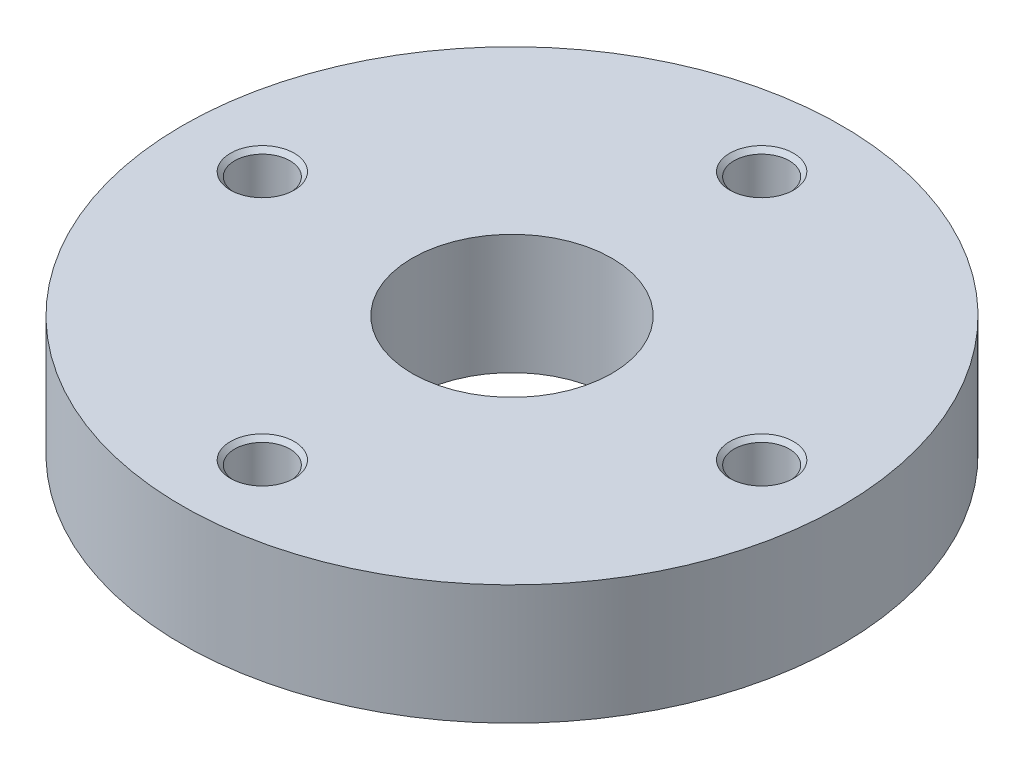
ISO-10303-21;
HEADER;
FILE_DESCRIPTION(('STEP AP214'),'2;1');
FILE_NAME('part.step','',(''),(''),'','','');
FILE_SCHEMA(('AUTOMOTIVE_DESIGN { 1 0 10303 214 1 1 1 1 }'));
ENDSEC;
DATA;
#1=APPLICATION_CONTEXT('core data for automotive mechanical design processes');
#2=APPLICATION_PROTOCOL_DEFINITION('international standard','automotive_design',2000,#1);
#3=PRODUCT_CONTEXT('',#1,'mechanical');
#4=PRODUCT('Part','Part','',(#3));
#5=PRODUCT_RELATED_PRODUCT_CATEGORY('part','',(#4));
#6=PRODUCT_DEFINITION_FORMATION('','',#4);
#7=PRODUCT_DEFINITION_CONTEXT('part definition',#1,'design');
#8=PRODUCT_DEFINITION('design','',#6,#7);
#9=PRODUCT_DEFINITION_SHAPE('','',#8);
#10=(LENGTH_UNIT() NAMED_UNIT(*) SI_UNIT(.MILLI.,.METRE.));
#11=(NAMED_UNIT(*) PLANE_ANGLE_UNIT() SI_UNIT($,.RADIAN.));
#12=(NAMED_UNIT(*) SI_UNIT($,.STERADIAN.) SOLID_ANGLE_UNIT());
#13=UNCERTAINTY_MEASURE_WITH_UNIT(LENGTH_MEASURE(1.E-05),#10,'distance_accuracy_value','');
#14=(GEOMETRIC_REPRESENTATION_CONTEXT(3) GLOBAL_UNCERTAINTY_ASSIGNED_CONTEXT((#13)) GLOBAL_UNIT_ASSIGNED_CONTEXT((#10,
#11,#12)) REPRESENTATION_CONTEXT('',''));
#15=CARTESIAN_POINT('',(0.,0.,0.));
#16=DIRECTION('',(0.,0.,1.));
#17=DIRECTION('',(1.,0.,0.));
#18=AXIS2_PLACEMENT_3D('',#15,#16,#17);
#19=CARTESIAN_POINT('',(0.,15.,0.));
#20=DIRECTION('',(0.,-1.,0.));
#21=DIRECTION('',(1.,0.,0.));
#22=AXIS2_PLACEMENT_3D('',#19,#20,#21);
#23=CYLINDRICAL_SURFACE('',#22,82.5);
#24=CARTESIAN_POINT('',(0.,0.,0.));
#25=DIRECTION('',(0.,1.,0.));
#26=DIRECTION('',(1.,0.,0.));
#27=AXIS2_PLACEMENT_3D('',#24,#25,#26);
#28=CIRCLE('',#27,82.5);
#29=CARTESIAN_POINT('',(82.5,0.,0.));
#30=VERTEX_POINT('',#29);
#31=EDGE_CURVE('E9',#30,#30,#28,.T.);
#32=ORIENTED_EDGE('',*,*,#31,.T.);
#33=EDGE_LOOP('',(#32));
#34=FACE_BOUND('',#33,.T.);
#35=CARTESIAN_POINT('',(0.,30.,0.));
#36=DIRECTION('',(0.,1.,0.));
#37=DIRECTION('',(1.,0.,0.));
#38=AXIS2_PLACEMENT_3D('',#35,#36,#37);
#39=CIRCLE('',#38,82.5);
#40=CARTESIAN_POINT('',(82.5,30.,0.));
#41=VERTEX_POINT('',#40);
#42=EDGE_CURVE('E125',#41,#41,#39,.T.);
#43=ORIENTED_EDGE('',*,*,#42,.F.);
#44=EDGE_LOOP('',(#43));
#45=FACE_BOUND('',#44,.T.);
#46=ADVANCED_FACE('F15',(#34,#45),#23,.T.);
#47=CARTESIAN_POINT('',(53.75,0.,0.));
#48=DIRECTION('',(0.,-1.,0.));
#49=DIRECTION('',(-1.,0.,0.));
#50=AXIS2_PLACEMENT_3D('',#47,#48,#49);
#51=PLANE('',#50);
#52=CARTESIAN_POINT('',(0.,0.,0.));
#53=DIRECTION('',(0.,1.,0.));
#54=DIRECTION('',(1.,0.,0.));
#55=AXIS2_PLACEMENT_3D('',#52,#53,#54);
#56=CIRCLE('',#55,25.);
#57=CARTESIAN_POINT('',(25.,0.,0.));
#58=VERTEX_POINT('',#57);
#59=EDGE_CURVE('E25',#58,#58,#56,.T.);
#60=ORIENTED_EDGE('',*,*,#59,.T.);
#61=EDGE_LOOP('',(#60));
#62=FACE_BOUND('',#61,.T.);
#63=ORIENTED_EDGE('',*,*,#31,.F.);
#64=EDGE_LOOP('',(#63));
#65=FACE_BOUND('',#64,.T.);
#66=ADVANCED_FACE('F216',(#62,#65),#51,.T.);
#67=CARTESIAN_POINT('',(0.,15.,0.));
#68=DIRECTION('',(0.,-1.,0.));
#69=DIRECTION('',(1.,0.,0.));
#70=AXIS2_PLACEMENT_3D('',#67,#68,#69);
#71=CYLINDRICAL_SURFACE('',#70,25.);
#72=CARTESIAN_POINT('',(0.,30.,0.));
#73=DIRECTION('',(0.,1.,0.));
#74=DIRECTION('',(1.,0.,0.));
#75=AXIS2_PLACEMENT_3D('',#72,#73,#74);
#76=CIRCLE('',#75,25.);
#77=CARTESIAN_POINT('',(25.,30.,0.));
#78=VERTEX_POINT('',#77);
#79=EDGE_CURVE('E129',#78,#78,#76,.T.);
#80=ORIENTED_EDGE('',*,*,#79,.T.);
#81=EDGE_LOOP('',(#80));
#82=FACE_BOUND('',#81,.T.);
#83=ORIENTED_EDGE('',*,*,#59,.F.);
#84=EDGE_LOOP('',(#83));
#85=FACE_BOUND('',#84,.T.);
#86=ADVANCED_FACE('F221',(#82,#85),#71,.F.);
#87=CARTESIAN_POINT('',(53.75,30.,0.));
#88=DIRECTION('',(0.,1.,0.));
#89=DIRECTION('',(1.,0.,0.));
#90=AXIS2_PLACEMENT_3D('',#87,#88,#89);
#91=PLANE('',#90);
#92=ORIENTED_EDGE('',*,*,#42,.T.);
#93=EDGE_LOOP('',(#92));
#94=FACE_BOUND('',#93,.T.);
#95=ORIENTED_EDGE('',*,*,#79,.F.);
#96=EDGE_LOOP('',(#95));
#97=FACE_BOUND('',#96,.T.);
#98=CARTESIAN_POINT('',(62.5,30.,0.));
#99=DIRECTION('',(0.,-1.,0.));
#100=DIRECTION('',(1.,0.,0.));
#101=AXIS2_PLACEMENT_3D('',#98,#99,#100);
#102=CIRCLE('',#101,8.);
#103=CARTESIAN_POINT('',(70.5,30.,0.));
#104=VERTEX_POINT('',#103);
#105=EDGE_CURVE('E152',#104,#104,#102,.T.);
#106=ORIENTED_EDGE('',*,*,#105,.T.);
#107=EDGE_LOOP('',(#106));
#108=FACE_BOUND('',#107,.T.);
#109=CARTESIAN_POINT('',(0.,30.,-62.5));
#110=DIRECTION('',(0.,-1.,0.));
#111=DIRECTION('',(0.,0.,-1.));
#112=AXIS2_PLACEMENT_3D('',#109,#110,#111);
#113=CIRCLE('',#112,8.);
#114=CARTESIAN_POINT('',(0.,30.,-70.5));
#115=VERTEX_POINT('',#114);
#116=EDGE_CURVE('E151',#115,#115,#113,.T.);
#117=ORIENTED_EDGE('',*,*,#116,.T.);
#118=EDGE_LOOP('',(#117));
#119=FACE_BOUND('',#118,.T.);
#120=CARTESIAN_POINT('',(-62.5,30.,0.));
#121=DIRECTION('',(0.,-1.,0.));
#122=DIRECTION('',(-1.,0.,0.));
#123=AXIS2_PLACEMENT_3D('',#120,#121,#122);
#124=CIRCLE('',#123,8.);
#125=CARTESIAN_POINT('',(-70.5,30.,0.));
#126=VERTEX_POINT('',#125);
#127=EDGE_CURVE('E172',#126,#126,#124,.T.);
#128=ORIENTED_EDGE('',*,*,#127,.T.);
#129=EDGE_LOOP('',(#128));
#130=FACE_BOUND('',#129,.T.);
#131=CARTESIAN_POINT('',(0.,30.,62.5));
#132=DIRECTION('',(0.,-1.,0.));
#133=DIRECTION('',(0.,0.,1.));
#134=AXIS2_PLACEMENT_3D('',#131,#132,#133);
#135=CIRCLE('',#134,8.);
#136=CARTESIAN_POINT('',(0.,30.,70.5));
#137=VERTEX_POINT('',#136);
#138=EDGE_CURVE('E96',#137,#137,#135,.T.);
#139=ORIENTED_EDGE('',*,*,#138,.T.);
#140=EDGE_LOOP('',(#139));
#141=FACE_BOUND('',#140,.T.);
#142=ADVANCED_FACE('F261',(#94,#97,#108,#119,#130,#141),#91,.T.);
#143=CARTESIAN_POINT('',(62.5,5.00308975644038,0.));
#144=DIRECTION('',(0.,1.,0.));
#145=DIRECTION('',(1.,0.,0.));
#146=AXIS2_PLACEMENT_3D('',#143,#144,#145);
#147=CONICAL_SURFACE('',#146,3.45875,1.0471975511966);
#148=CARTESIAN_POINT('',(62.5,7.,0.));
#149=DIRECTION('',(0.,-1.,0.));
#150=DIRECTION('',(1.,0.,0.));
#151=AXIS2_PLACEMENT_3D('',#148,#149,#150);
#152=CIRCLE('',#151,6.9175);
#153=CARTESIAN_POINT('',(69.4175,7.,0.));
#154=VERTEX_POINT('',#153);
#155=EDGE_CURVE('E133',#154,#154,#152,.T.);
#156=ORIENTED_EDGE('',*,*,#155,.F.);
#157=EDGE_LOOP('',(#156));
#158=FACE_BOUND('',#157,.T.);
#159=CARTESIAN_POINT('',(62.5,3.00617951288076,0.));
#160=VERTEX_POINT('',#159);
#161=VERTEX_LOOP('',#160);
#162=FACE_BOUND('',#161,.T.);
#163=ADVANCED_FACE('F257',(#158,#162),#147,.F.);
#164=CARTESIAN_POINT('',(62.5,9.95875,0.));
#165=DIRECTION('',(0.,1.,0.));
#166=DIRECTION('',(1.,0.,0.));
#167=AXIS2_PLACEMENT_3D('',#164,#165,#166);
#168=CYLINDRICAL_SURFACE('',#167,6.9175);
#169=CARTESIAN_POINT('',(62.5,12.9175,0.));
#170=DIRECTION('',(0.,-1.,0.));
#171=DIRECTION('',(1.,0.,0.));
#172=AXIS2_PLACEMENT_3D('',#169,#170,#171);
#173=CIRCLE('',#172,6.9175);
#174=CARTESIAN_POINT('',(69.4175,12.9175,0.));
#175=VERTEX_POINT('',#174);
#176=EDGE_CURVE('E137',#175,#175,#173,.T.);
#177=ORIENTED_EDGE('',*,*,#176,.F.);
#178=EDGE_LOOP('',(#177));
#179=FACE_BOUND('',#178,.T.);
#180=ORIENTED_EDGE('',*,*,#155,.T.);
#181=EDGE_LOOP('',(#180));
#182=FACE_BOUND('',#181,.T.);
#183=ADVANCED_FACE('F260',(#179,#182),#168,.F.);
#184=CARTESIAN_POINT('',(62.5,13.45875,0.));
#185=DIRECTION('',(0.,1.,0.));
#186=DIRECTION('',(1.,0.,0.));
#187=AXIS2_PLACEMENT_3D('',#184,#185,#186);
#188=CONICAL_SURFACE('',#187,7.45875,0.785398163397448);
#189=CARTESIAN_POINT('',(62.5,14.,0.));
#190=DIRECTION('',(0.,-1.,0.));
#191=DIRECTION('',(1.,0.,0.));
#192=AXIS2_PLACEMENT_3D('',#189,#190,#191);
#193=CIRCLE('',#192,8.);
#194=CARTESIAN_POINT('',(70.5,14.,0.));
#195=VERTEX_POINT('',#194);
#196=EDGE_CURVE('E139',#195,#195,#193,.T.);
#197=ORIENTED_EDGE('',*,*,#196,.F.);
#198=EDGE_LOOP('',(#197));
#199=FACE_BOUND('',#198,.T.);
#200=ORIENTED_EDGE('',*,*,#176,.T.);
#201=EDGE_LOOP('',(#200));
#202=FACE_BOUND('',#201,.T.);
#203=ADVANCED_FACE('F17',(#199,#202),#188,.F.);
#204=CARTESIAN_POINT('',(69.95875,14.,0.));
#205=DIRECTION('',(0.,1.,0.));
#206=DIRECTION('',(-1.,0.,0.));
#207=AXIS2_PLACEMENT_3D('',#204,#205,#206);
#208=PLANE('',#207);
#209=CARTESIAN_POINT('',(62.5,14.,0.));
#210=DIRECTION('',(0.,-1.,0.));
#211=DIRECTION('',(1.,0.,0.));
#212=AXIS2_PLACEMENT_3D('',#209,#210,#211);
#213=CIRCLE('',#212,6.9175);
#214=CARTESIAN_POINT('',(69.4175,14.,0.));
#215=VERTEX_POINT('',#214);
#216=EDGE_CURVE('E142',#215,#215,#213,.T.);
#217=ORIENTED_EDGE('',*,*,#216,.F.);
#218=EDGE_LOOP('',(#217));
#219=FACE_BOUND('',#218,.T.);
#220=ORIENTED_EDGE('',*,*,#196,.T.);
#221=EDGE_LOOP('',(#220));
#222=FACE_BOUND('',#221,.T.);
#223=ADVANCED_FACE('F275',(#219,#222),#208,.F.);
#224=CARTESIAN_POINT('',(62.5,21.45875,0.));
#225=DIRECTION('',(0.,1.,0.));
#226=DIRECTION('',(1.,0.,0.));
#227=AXIS2_PLACEMENT_3D('',#224,#225,#226);
#228=CYLINDRICAL_SURFACE('',#227,6.9175);
#229=CARTESIAN_POINT('',(62.5,28.9175,0.));
#230=DIRECTION('',(0.,-1.,0.));
#231=DIRECTION('',(1.,0.,0.));
#232=AXIS2_PLACEMENT_3D('',#229,#230,#231);
#233=CIRCLE('',#232,6.9175);
#234=CARTESIAN_POINT('',(69.4175,28.9175,0.));
#235=VERTEX_POINT('',#234);
#236=EDGE_CURVE('E146',#235,#235,#233,.T.);
#237=ORIENTED_EDGE('',*,*,#236,.F.);
#238=EDGE_LOOP('',(#237));
#239=FACE_BOUND('',#238,.T.);
#240=ORIENTED_EDGE('',*,*,#216,.T.);
#241=EDGE_LOOP('',(#240));
#242=FACE_BOUND('',#241,.T.);
#243=ADVANCED_FACE('F272',(#239,#242),#228,.F.);
#244=CARTESIAN_POINT('',(62.5,29.45875,0.));
#245=DIRECTION('',(0.,1.,0.));
#246=DIRECTION('',(1.,0.,0.));
#247=AXIS2_PLACEMENT_3D('',#244,#245,#246);
#248=CONICAL_SURFACE('',#247,7.45875,0.785398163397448);
#249=ORIENTED_EDGE('',*,*,#105,.F.);
#250=EDGE_LOOP('',(#249));
#251=FACE_BOUND('',#250,.T.);
#252=ORIENTED_EDGE('',*,*,#236,.T.);
#253=EDGE_LOOP('',(#252));
#254=FACE_BOUND('',#253,.T.);
#255=ADVANCED_FACE('F250',(#251,#254),#248,.F.);
#256=CARTESIAN_POINT('',(0.,5.00308975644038,-62.5));
#257=DIRECTION('',(0.,1.,0.));
#258=DIRECTION('',(0.,0.,-1.));
#259=AXIS2_PLACEMENT_3D('',#256,#257,#258);
#260=CONICAL_SURFACE('',#259,3.45875,1.0471975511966);
#261=CARTESIAN_POINT('',(0.,7.,-62.5));
#262=DIRECTION('',(0.,-1.,0.));
#263=DIRECTION('',(0.,0.,-1.));
#264=AXIS2_PLACEMENT_3D('',#261,#262,#263);
#265=CIRCLE('',#264,6.9175);
#266=CARTESIAN_POINT('',(0.,7.,-69.4175));
#267=VERTEX_POINT('',#266);
#268=EDGE_CURVE('E159',#267,#267,#265,.T.);
#269=ORIENTED_EDGE('',*,*,#268,.F.);
#270=EDGE_LOOP('',(#269));
#271=FACE_BOUND('',#270,.T.);
#272=CARTESIAN_POINT('',(0.,3.00617951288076,-62.5));
#273=VERTEX_POINT('',#272);
#274=VERTEX_LOOP('',#273);
#275=FACE_BOUND('',#274,.T.);
#276=ADVANCED_FACE('F227',(#271,#275),#260,.F.);
#277=CARTESIAN_POINT('',(0.,9.95875,-62.5));
#278=DIRECTION('',(0.,1.,0.));
#279=DIRECTION('',(0.,0.,-1.));
#280=AXIS2_PLACEMENT_3D('',#277,#278,#279);
#281=CYLINDRICAL_SURFACE('',#280,6.9175);
#282=CARTESIAN_POINT('',(0.,12.9175,-62.5));
#283=DIRECTION('',(0.,-1.,0.));
#284=DIRECTION('',(0.,0.,-1.));
#285=AXIS2_PLACEMENT_3D('',#282,#283,#284);
#286=CIRCLE('',#285,6.9175);
#287=CARTESIAN_POINT('',(0.,12.9175,-69.4175));
#288=VERTEX_POINT('',#287);
#289=EDGE_CURVE('E157',#288,#288,#286,.T.);
#290=ORIENTED_EDGE('',*,*,#289,.F.);
#291=EDGE_LOOP('',(#290));
#292=FACE_BOUND('',#291,.T.);
#293=ORIENTED_EDGE('',*,*,#268,.T.);
#294=EDGE_LOOP('',(#293));
#295=FACE_BOUND('',#294,.T.);
#296=ADVANCED_FACE('F237',(#292,#295),#281,.F.);
#297=CARTESIAN_POINT('',(0.,13.45875,-62.5));
#298=DIRECTION('',(0.,1.,0.));
#299=DIRECTION('',(0.,0.,-1.));
#300=AXIS2_PLACEMENT_3D('',#297,#298,#299);
#301=CONICAL_SURFACE('',#300,7.45875,0.785398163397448);
#302=CARTESIAN_POINT('',(0.,14.,-62.5));
#303=DIRECTION('',(0.,-1.,0.));
#304=DIRECTION('',(0.,0.,-1.));
#305=AXIS2_PLACEMENT_3D('',#302,#303,#304);
#306=CIRCLE('',#305,8.);
#307=CARTESIAN_POINT('',(0.,14.,-70.5));
#308=VERTEX_POINT('',#307);
#309=EDGE_CURVE('E150',#308,#308,#306,.T.);
#310=ORIENTED_EDGE('',*,*,#309,.F.);
#311=EDGE_LOOP('',(#310));
#312=FACE_BOUND('',#311,.T.);
#313=ORIENTED_EDGE('',*,*,#289,.T.);
#314=EDGE_LOOP('',(#313));
#315=FACE_BOUND('',#314,.T.);
#316=ADVANCED_FACE('F234',(#312,#315),#301,.F.);
#317=CARTESIAN_POINT('',(0.,14.,-69.95875));
#318=DIRECTION('',(0.,1.,0.));
#319=DIRECTION('',(0.,0.,1.));
#320=AXIS2_PLACEMENT_3D('',#317,#318,#319);
#321=PLANE('',#320);
#322=CARTESIAN_POINT('',(0.,14.,-62.5));
#323=DIRECTION('',(0.,-1.,0.));
#324=DIRECTION('',(0.,0.,-1.));
#325=AXIS2_PLACEMENT_3D('',#322,#323,#324);
#326=CIRCLE('',#325,6.9175);
#327=CARTESIAN_POINT('',(0.,14.,-69.4175));
#328=VERTEX_POINT('',#327);
#329=EDGE_CURVE('E148',#328,#328,#326,.T.);
#330=ORIENTED_EDGE('',*,*,#329,.F.);
#331=EDGE_LOOP('',(#330));
#332=FACE_BOUND('',#331,.T.);
#333=ORIENTED_EDGE('',*,*,#309,.T.);
#334=EDGE_LOOP('',(#333));
#335=FACE_BOUND('',#334,.T.);
#336=ADVANCED_FACE('F236',(#332,#335),#321,.F.);
#337=CARTESIAN_POINT('',(0.,21.45875,-62.5));
#338=DIRECTION('',(0.,1.,0.));
#339=DIRECTION('',(0.,0.,-1.));
#340=AXIS2_PLACEMENT_3D('',#337,#338,#339);
#341=CYLINDRICAL_SURFACE('',#340,6.9175);
#342=CARTESIAN_POINT('',(0.,28.9175,-62.5));
#343=DIRECTION('',(0.,-1.,0.));
#344=DIRECTION('',(0.,0.,-1.));
#345=AXIS2_PLACEMENT_3D('',#342,#343,#344);
#346=CIRCLE('',#345,6.9175);
#347=CARTESIAN_POINT('',(0.,28.9175,-69.4175));
#348=VERTEX_POINT('',#347);
#349=EDGE_CURVE('E176',#348,#348,#346,.T.);
#350=ORIENTED_EDGE('',*,*,#349,.F.);
#351=EDGE_LOOP('',(#350));
#352=FACE_BOUND('',#351,.T.);
#353=ORIENTED_EDGE('',*,*,#329,.T.);
#354=EDGE_LOOP('',(#353));
#355=FACE_BOUND('',#354,.T.);
#356=ADVANCED_FACE('F243',(#352,#355),#341,.F.);
#357=CARTESIAN_POINT('',(0.,29.45875,-62.5));
#358=DIRECTION('',(0.,1.,0.));
#359=DIRECTION('',(0.,0.,-1.));
#360=AXIS2_PLACEMENT_3D('',#357,#358,#359);
#361=CONICAL_SURFACE('',#360,7.45875,0.785398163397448);
#362=ORIENTED_EDGE('',*,*,#116,.F.);
#363=EDGE_LOOP('',(#362));
#364=FACE_BOUND('',#363,.T.);
#365=ORIENTED_EDGE('',*,*,#349,.T.);
#366=EDGE_LOOP('',(#365));
#367=FACE_BOUND('',#366,.T.);
#368=ADVANCED_FACE('F232',(#364,#367),#361,.F.);
#369=CARTESIAN_POINT('',(-62.5,5.00308975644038,0.));
#370=DIRECTION('',(0.,1.,0.));
#371=DIRECTION('',(-1.,0.,0.));
#372=AXIS2_PLACEMENT_3D('',#369,#370,#371);
#373=CONICAL_SURFACE('',#372,3.45875,1.0471975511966);
#374=CARTESIAN_POINT('',(-62.5,7.,0.));
#375=DIRECTION('',(0.,-1.,0.));
#376=DIRECTION('',(-1.,0.,0.));
#377=AXIS2_PLACEMENT_3D('',#374,#375,#376);
#378=CIRCLE('',#377,6.9175);
#379=CARTESIAN_POINT('',(-69.4175,7.,0.));
#380=VERTEX_POINT('',#379);
#381=EDGE_CURVE('E19',#380,#380,#378,.T.);
#382=ORIENTED_EDGE('',*,*,#381,.F.);
#383=EDGE_LOOP('',(#382));
#384=FACE_BOUND('',#383,.T.);
#385=CARTESIAN_POINT('',(-62.5,3.00617951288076,0.));
#386=VERTEX_POINT('',#385);
#387=VERTEX_LOOP('',#386);
#388=FACE_BOUND('',#387,.T.);
#389=ADVANCED_FACE('F229',(#384,#388),#373,.F.);
#390=CARTESIAN_POINT('',(-62.5,9.95875,0.));
#391=DIRECTION('',(0.,1.,0.));
#392=DIRECTION('',(-1.,0.,0.));
#393=AXIS2_PLACEMENT_3D('',#390,#391,#392);
#394=CYLINDRICAL_SURFACE('',#393,6.9175);
#395=CARTESIAN_POINT('',(-62.5,12.9175,0.));
#396=DIRECTION('',(0.,-1.,0.));
#397=DIRECTION('',(-1.,0.,0.));
#398=AXIS2_PLACEMENT_3D('',#395,#396,#397);
#399=CIRCLE('',#398,6.9175);
#400=CARTESIAN_POINT('',(-69.4175,12.9175,0.));
#401=VERTEX_POINT('',#400);
#402=EDGE_CURVE('E155',#401,#401,#399,.T.);
#403=ORIENTED_EDGE('',*,*,#402,.F.);
#404=EDGE_LOOP('',(#403));
#405=FACE_BOUND('',#404,.T.);
#406=ORIENTED_EDGE('',*,*,#381,.T.);
#407=EDGE_LOOP('',(#406));
#408=FACE_BOUND('',#407,.T.);
#409=ADVANCED_FACE('F231',(#405,#408),#394,.F.);
#410=CARTESIAN_POINT('',(-62.5,13.45875,0.));
#411=DIRECTION('',(0.,1.,0.));
#412=DIRECTION('',(-1.,0.,0.));
#413=AXIS2_PLACEMENT_3D('',#410,#411,#412);
#414=CONICAL_SURFACE('',#413,7.45875,0.785398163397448);
#415=CARTESIAN_POINT('',(-62.5,14.,0.));
#416=DIRECTION('',(0.,-1.,0.));
#417=DIRECTION('',(-1.,0.,0.));
#418=AXIS2_PLACEMENT_3D('',#415,#416,#417);
#419=CIRCLE('',#418,8.);
#420=CARTESIAN_POINT('',(-70.5,14.,0.));
#421=VERTEX_POINT('',#420);
#422=EDGE_CURVE('E156',#421,#421,#419,.T.);
#423=ORIENTED_EDGE('',*,*,#422,.F.);
#424=EDGE_LOOP('',(#423));
#425=FACE_BOUND('',#424,.T.);
#426=ORIENTED_EDGE('',*,*,#402,.T.);
#427=EDGE_LOOP('',(#426));
#428=FACE_BOUND('',#427,.T.);
#429=ADVANCED_FACE('F263',(#425,#428),#414,.F.);
#430=CARTESIAN_POINT('',(-69.95875,14.,0.));
#431=DIRECTION('',(0.,1.,0.));
#432=DIRECTION('',(1.,0.,0.));
#433=AXIS2_PLACEMENT_3D('',#430,#431,#432);
#434=PLANE('',#433);
#435=CARTESIAN_POINT('',(-62.5,14.,0.));
#436=DIRECTION('',(0.,-1.,0.));
#437=DIRECTION('',(-1.,0.,0.));
#438=AXIS2_PLACEMENT_3D('',#435,#436,#437);
#439=CIRCLE('',#438,6.9175);
#440=CARTESIAN_POINT('',(-69.4175,14.,0.));
#441=VERTEX_POINT('',#440);
#442=EDGE_CURVE('E174',#441,#441,#439,.T.);
#443=ORIENTED_EDGE('',*,*,#442,.F.);
#444=EDGE_LOOP('',(#443));
#445=FACE_BOUND('',#444,.T.);
#446=ORIENTED_EDGE('',*,*,#422,.T.);
#447=EDGE_LOOP('',(#446));
#448=FACE_BOUND('',#447,.T.);
#449=ADVANCED_FACE('F266',(#445,#448),#434,.F.);
#450=CARTESIAN_POINT('',(-62.5,21.45875,0.));
#451=DIRECTION('',(0.,1.,0.));
#452=DIRECTION('',(-1.,0.,0.));
#453=AXIS2_PLACEMENT_3D('',#450,#451,#452);
#454=CYLINDRICAL_SURFACE('',#453,6.9175);
#455=CARTESIAN_POINT('',(-62.5,28.9175,0.));
#456=DIRECTION('',(0.,-1.,0.));
#457=DIRECTION('',(-1.,0.,0.));
#458=AXIS2_PLACEMENT_3D('',#455,#456,#457);
#459=CIRCLE('',#458,6.9175);
#460=CARTESIAN_POINT('',(-69.4175,28.9175,0.));
#461=VERTEX_POINT('',#460);
#462=EDGE_CURVE('E55',#461,#461,#459,.T.);
#463=ORIENTED_EDGE('',*,*,#462,.F.);
#464=EDGE_LOOP('',(#463));
#465=FACE_BOUND('',#464,.T.);
#466=ORIENTED_EDGE('',*,*,#442,.T.);
#467=EDGE_LOOP('',(#466));
#468=FACE_BOUND('',#467,.T.);
#469=ADVANCED_FACE('F299',(#465,#468),#454,.F.);
#470=CARTESIAN_POINT('',(-62.5,29.45875,0.));
#471=DIRECTION('',(0.,1.,0.));
#472=DIRECTION('',(-1.,0.,0.));
#473=AXIS2_PLACEMENT_3D('',#470,#471,#472);
#474=CONICAL_SURFACE('',#473,7.45875,0.785398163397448);
#475=ORIENTED_EDGE('',*,*,#127,.F.);
#476=EDGE_LOOP('',(#475));
#477=FACE_BOUND('',#476,.T.);
#478=ORIENTED_EDGE('',*,*,#462,.T.);
#479=EDGE_LOOP('',(#478));
#480=FACE_BOUND('',#479,.T.);
#481=ADVANCED_FACE('F210',(#477,#480),#474,.F.);
#482=CARTESIAN_POINT('',(0.,5.00308975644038,62.5));
#483=DIRECTION('',(0.,1.,0.));
#484=DIRECTION('',(0.,0.,1.));
#485=AXIS2_PLACEMENT_3D('',#482,#483,#484);
#486=CONICAL_SURFACE('',#485,3.45875,1.0471975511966);
#487=CARTESIAN_POINT('',(0.,7.,62.5));
#488=DIRECTION('',(0.,-1.,0.));
#489=DIRECTION('',(0.,0.,1.));
#490=AXIS2_PLACEMENT_3D('',#487,#488,#489);
#491=CIRCLE('',#490,6.9175);
#492=CARTESIAN_POINT('',(0.,7.,69.4175));
#493=VERTEX_POINT('',#492);
#494=EDGE_CURVE('E64',#493,#493,#491,.T.);
#495=ORIENTED_EDGE('',*,*,#494,.F.);
#496=EDGE_LOOP('',(#495));
#497=FACE_BOUND('',#496,.T.);
#498=CARTESIAN_POINT('',(0.,3.00617951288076,62.5));
#499=VERTEX_POINT('',#498);
#500=VERTEX_LOOP('',#499);
#501=FACE_BOUND('',#500,.T.);
#502=ADVANCED_FACE('F204',(#497,#501),#486,.F.);
#503=CARTESIAN_POINT('',(0.,9.95875,62.5));
#504=DIRECTION('',(0.,1.,0.));
#505=DIRECTION('',(0.,0.,1.));
#506=AXIS2_PLACEMENT_3D('',#503,#504,#505);
#507=CYLINDRICAL_SURFACE('',#506,6.9175);
#508=CARTESIAN_POINT('',(0.,12.9175,62.5));
#509=DIRECTION('',(0.,-1.,0.));
#510=DIRECTION('',(0.,0.,1.));
#511=AXIS2_PLACEMENT_3D('',#508,#509,#510);
#512=CIRCLE('',#511,6.9175);
#513=CARTESIAN_POINT('',(0.,12.9175,69.4175));
#514=VERTEX_POINT('',#513);
#515=EDGE_CURVE('E189',#514,#514,#512,.T.);
#516=ORIENTED_EDGE('',*,*,#515,.F.);
#517=EDGE_LOOP('',(#516));
#518=FACE_BOUND('',#517,.T.);
#519=ORIENTED_EDGE('',*,*,#494,.T.);
#520=EDGE_LOOP('',(#519));
#521=FACE_BOUND('',#520,.T.);
#522=ADVANCED_FACE('F199',(#518,#521),#507,.F.);
#523=CARTESIAN_POINT('',(0.,13.45875,62.5));
#524=DIRECTION('',(0.,1.,0.));
#525=DIRECTION('',(0.,0.,1.));
#526=AXIS2_PLACEMENT_3D('',#523,#524,#525);
#527=CONICAL_SURFACE('',#526,7.45875,0.785398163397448);
#528=CARTESIAN_POINT('',(0.,14.,62.5));
#529=DIRECTION('',(0.,-1.,0.));
#530=DIRECTION('',(0.,0.,1.));
#531=AXIS2_PLACEMENT_3D('',#528,#529,#530);
#532=CIRCLE('',#531,8.);
#533=CARTESIAN_POINT('',(0.,14.,70.5));
#534=VERTEX_POINT('',#533);
#535=EDGE_CURVE('E191',#534,#534,#532,.T.);
#536=ORIENTED_EDGE('',*,*,#535,.F.);
#537=EDGE_LOOP('',(#536));
#538=FACE_BOUND('',#537,.T.);
#539=ORIENTED_EDGE('',*,*,#515,.T.);
#540=EDGE_LOOP('',(#539));
#541=FACE_BOUND('',#540,.T.);
#542=ADVANCED_FACE('F196',(#538,#541),#527,.F.);
#543=CARTESIAN_POINT('',(0.,14.,69.95875));
#544=DIRECTION('',(0.,1.,0.));
#545=DIRECTION('',(0.,0.,-1.));
#546=AXIS2_PLACEMENT_3D('',#543,#544,#545);
#547=PLANE('',#546);
#548=CARTESIAN_POINT('',(0.,14.,62.5));
#549=DIRECTION('',(0.,-1.,0.));
#550=DIRECTION('',(0.,0.,1.));
#551=AXIS2_PLACEMENT_3D('',#548,#549,#550);
#552=CIRCLE('',#551,6.9175);
#553=CARTESIAN_POINT('',(0.,14.,69.4175));
#554=VERTEX_POINT('',#553);
#555=EDGE_CURVE('E101',#554,#554,#552,.T.);
#556=ORIENTED_EDGE('',*,*,#555,.F.);
#557=EDGE_LOOP('',(#556));
#558=FACE_BOUND('',#557,.T.);
#559=ORIENTED_EDGE('',*,*,#535,.T.);
#560=EDGE_LOOP('',(#559));
#561=FACE_BOUND('',#560,.T.);
#562=ADVANCED_FACE('F194',(#558,#561),#547,.F.);
#563=CARTESIAN_POINT('',(0.,21.45875,62.5));
#564=DIRECTION('',(0.,1.,0.));
#565=DIRECTION('',(0.,0.,1.));
#566=AXIS2_PLACEMENT_3D('',#563,#564,#565);
#567=CYLINDRICAL_SURFACE('',#566,6.9175);
#568=CARTESIAN_POINT('',(0.,28.9175,62.5));
#569=DIRECTION('',(0.,-1.,0.));
#570=DIRECTION('',(0.,0.,1.));
#571=AXIS2_PLACEMENT_3D('',#568,#569,#570);
#572=CIRCLE('',#571,6.9175);
#573=CARTESIAN_POINT('',(0.,28.9175,69.4175));
#574=VERTEX_POINT('',#573);
#575=EDGE_CURVE('E169',#574,#574,#572,.T.);
#576=ORIENTED_EDGE('',*,*,#575,.F.);
#577=EDGE_LOOP('',(#576));
#578=FACE_BOUND('',#577,.T.);
#579=ORIENTED_EDGE('',*,*,#555,.T.);
#580=EDGE_LOOP('',(#579));
#581=FACE_BOUND('',#580,.T.);
#582=ADVANCED_FACE('F279',(#578,#581),#567,.F.);
#583=CARTESIAN_POINT('',(0.,29.45875,62.5));
#584=DIRECTION('',(0.,1.,0.));
#585=DIRECTION('',(0.,0.,1.));
#586=AXIS2_PLACEMENT_3D('',#583,#584,#585);
#587=CONICAL_SURFACE('',#586,7.45875,0.785398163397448);
#588=ORIENTED_EDGE('',*,*,#138,.F.);
#589=EDGE_LOOP('',(#588));
#590=FACE_BOUND('',#589,.T.);
#591=ORIENTED_EDGE('',*,*,#575,.T.);
#592=EDGE_LOOP('',(#591));
#593=FACE_BOUND('',#592,.T.);
#594=ADVANCED_FACE('F255',(#590,#593),#587,.F.);
#595=CLOSED_SHELL('',(#46,#66,#86,#142,#163,#183,#203,#223,#243,#255,#276,#296,#316,#336,#356,
#368,#389,#409,#429,#449,#469,#481,#502,#522,#542,#562,#582,#594));
#596=MANIFOLD_SOLID_BREP('B1',#595);
#597=ADVANCED_BREP_SHAPE_REPRESENTATION('',(#18,#596),#14);
#598=SHAPE_DEFINITION_REPRESENTATION(#9,#597);
ENDSEC;
END-ISO-10303-21;
